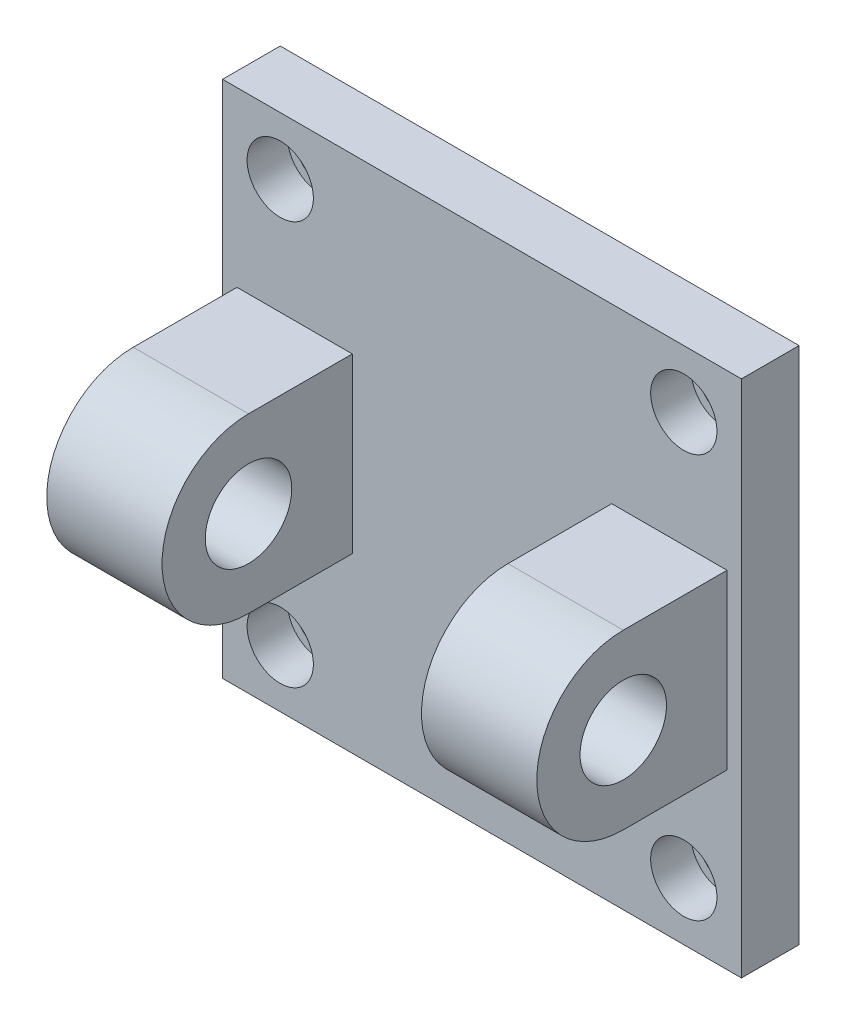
from build123d import *

# Parameters (mm, degrees)
SKETCH_1_W          = 180
SKETCH_1_H          = 180
EXTRUDE_1_DEPTH     = 20
EXTRUDE_2_DEPTH     = 180
SKETCH_5_W          = 5
SKETCH_5_H          = 180
SKETCH_5_W_2        = 90
CUT_EXTRUDE_1_DEPTH = 70
SKETCH_6_R          = 15
CUT_EXTRUDE_2_DEPTH = 215.758003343
SKETCH_7_R          = 8.5
CUT_EXTRUDE_3_DEPTH = 144.373637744
SKETCH_8_R          = 11.5
CUT_EXTRUDE_4_DEPTH = 14


with BuildPart() as part:
    # Sketch 1 → Extrude 1 (new body)
    with BuildSketch(Plane.XY):
        Rectangle(SKETCH_1_W, SKETCH_1_H)
    extrude(amount=EXTRUDE_1_DEPTH)

    # Sketch 4 → Extrude 2 (add)
    with BuildSketch(Plane.ZY.offset(90)):
        with BuildLine():
            Line((20, 30), (56, 30))
            ThreePointArc((56, 30), (86, 0), (56, -30))
            Line((56, -30), (20, -30))
            Line((20, -30), (20, 30))
        make_face()
    extrude(amount=-EXTRUDE_2_DEPTH)

    # Sketch 5 → Cut-Extrude 1 (cut)
    with BuildSketch(Plane.XY.offset(20)):
        with Locations((-87.5, 0)):
            Rectangle(SKETCH_5_W, SKETCH_5_H)
        with Locations((87.5, 0)):
            Rectangle(SKETCH_5_W, SKETCH_5_H)
        Rectangle(SKETCH_5_W_2, SKETCH_5_H)
    extrude(amount=CUT_EXTRUDE_1_DEPTH, mode=Mode.SUBTRACT)

    # Sketch 6 → Cut-Extrude 2 (cut, through all)
    with BuildSketch(Plane.ZY.offset(85)):
        with Locations(Location((56, 0, 0), (0, 0, 270))):
            Circle(SKETCH_6_R)
    extrude(amount=-CUT_EXTRUDE_2_DEPTH, mode=Mode.SUBTRACT)

    # Sketch 7 → Cut-Extrude 3 (cut, through all)
    with BuildSketch(Plane.XY.offset(20)):
        with Locations((-70, 70)):
            Circle(SKETCH_7_R)
        with Locations((70, 70)):
            Circle(SKETCH_7_R)
        with Locations((70, -70)):
            Circle(SKETCH_7_R)
        with Locations((-70, -70)):
            Circle(SKETCH_7_R)
    extrude(amount=-CUT_EXTRUDE_3_DEPTH, mode=Mode.SUBTRACT)

    # Sketch 8 → Cut-Extrude 4 (cut)
    with BuildSketch(Plane.XY.offset(20)):
        with Locations((-70, 70)):
            Circle(SKETCH_8_R)
        with Locations((70, 70)):
            Circle(SKETCH_8_R)
        with Locations((-70, -70)):
            Circle(SKETCH_8_R)
        with Locations((70, -70)):
            Circle(SKETCH_8_R)
    extrude(amount=-CUT_EXTRUDE_4_DEPTH, mode=Mode.SUBTRACT)


solid = part.part
